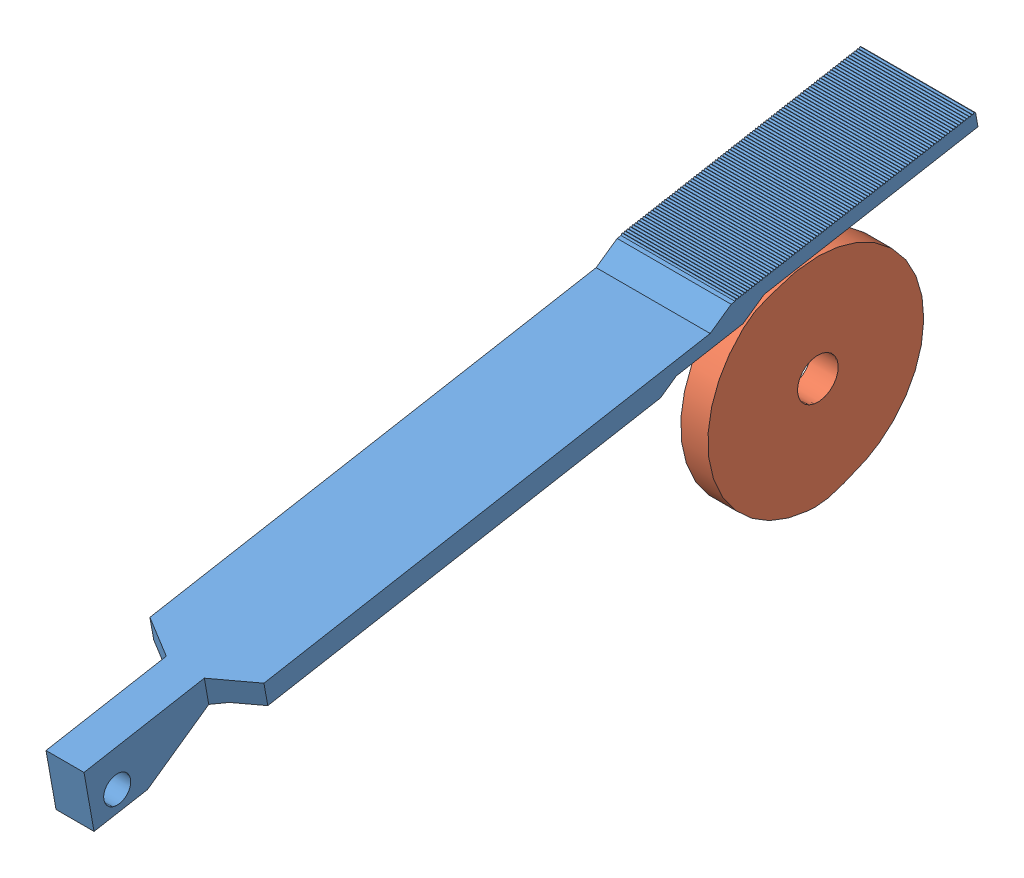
SolidWorks assembly Zufuehrungseinheit_000_vereinfacht.SLDASM, configuration Standard (file format 3800). Lengths in mm.
Overall size (42 143.45 357.21).
2 component instances, 2 part files, 6 mates.
Components (placement in the parent):
- Rueckhalteblech_000-1: Rueckhalteblech_000.SLDPRT [Standard] at (0 -9.1417 8.5252) x (0 0.175864 -0.984415) z (1 0 0) size (320 25.5 42)
- Kurvenscheibe_000_mod-2: Kurvenscheibe_000_mod.SLDPRT [Standard] at (0 0 -260) x (0 -0.564481 0.825446) z (-1 0 0) size (127.97 86.28 10)
Mates (geometry in assembly coordinates):
- Deckungsgleich52: coincident aligned: unknown of Rueckhalteblech_000-1
- Deckungsgleich50: coincident: axis of Rueckhalteblech_000-1
- Deckungsgleich55: coincident: unknown of Kurvenscheibe_000_mod-2
- Deckungsgleich53: coincident anti-aligned: unknown of Kurvenscheibe_000_mod-2
- Abstand30: distance = 260 mm: unknown of Kurvenscheibe_000_mod-2
- Tangential2: tangent anti-aligned: plane of Rueckhalteblech_000-1 through (21 12.0757 -36.321) normal (0 -0.984415 -0.175864); cylinder of ?
